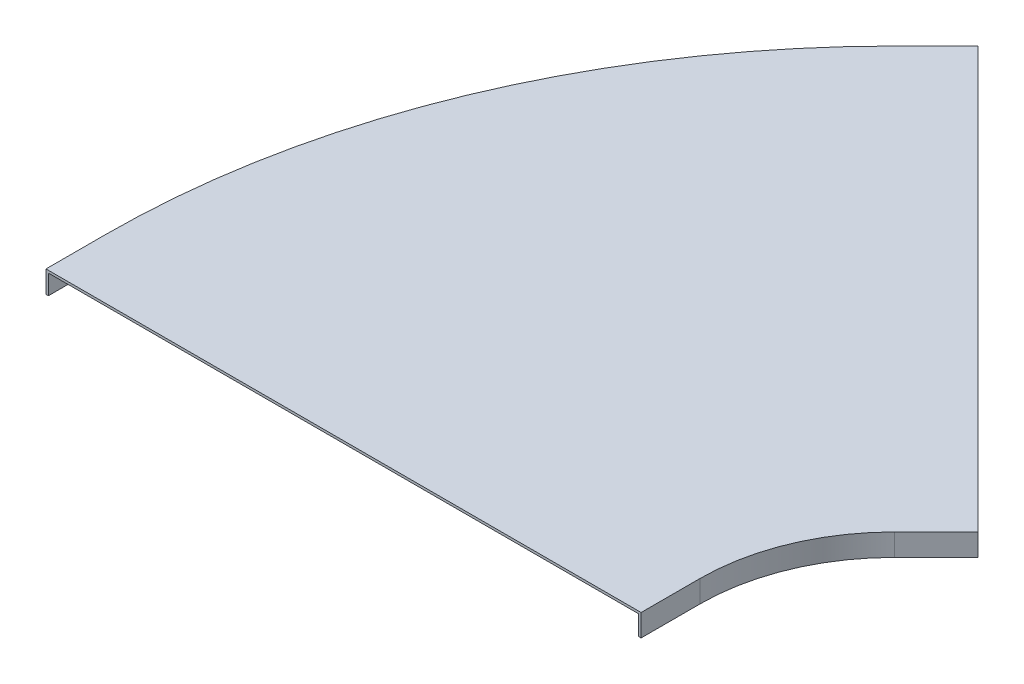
ISO-10303-21;
HEADER;
FILE_DESCRIPTION(('STEP AP214'),'2;1');
FILE_NAME('part.step','',(''),(''),'','','');
FILE_SCHEMA(('AUTOMOTIVE_DESIGN { 1 0 10303 214 1 1 1 1 }'));
ENDSEC;
DATA;
#1=APPLICATION_CONTEXT('core data for automotive mechanical design processes');
#2=APPLICATION_PROTOCOL_DEFINITION('international standard','automotive_design',2000,#1);
#3=PRODUCT_CONTEXT('',#1,'mechanical');
#4=PRODUCT('Part','Part','',(#3));
#5=PRODUCT_RELATED_PRODUCT_CATEGORY('part','',(#4));
#6=PRODUCT_DEFINITION_FORMATION('','',#4);
#7=PRODUCT_DEFINITION_CONTEXT('part definition',#1,'design');
#8=PRODUCT_DEFINITION('design','',#6,#7);
#9=PRODUCT_DEFINITION_SHAPE('','',#8);
#10=(LENGTH_UNIT() NAMED_UNIT(*) SI_UNIT(.MILLI.,.METRE.));
#11=(NAMED_UNIT(*) PLANE_ANGLE_UNIT() SI_UNIT($,.RADIAN.));
#12=(NAMED_UNIT(*) SI_UNIT($,.STERADIAN.) SOLID_ANGLE_UNIT());
#13=UNCERTAINTY_MEASURE_WITH_UNIT(LENGTH_MEASURE(1.E-05),#10,'distance_accuracy_value','');
#14=(GEOMETRIC_REPRESENTATION_CONTEXT(3) GLOBAL_UNCERTAINTY_ASSIGNED_CONTEXT((#13)) GLOBAL_UNIT_ASSIGNED_CONTEXT((#10,
#11,#12)) REPRESENTATION_CONTEXT('',''));
#15=CARTESIAN_POINT('',(0.,0.,0.));
#16=DIRECTION('',(0.,0.,1.));
#17=DIRECTION('',(1.,0.,0.));
#18=AXIS2_PLACEMENT_3D('',#15,#16,#17);
#19=CARTESIAN_POINT('',(29.2893218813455,-10.,-100.710678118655));
#20=DIRECTION('',(0.707106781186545,0.,0.70710678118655));
#21=DIRECTION('',(0.70710678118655,0.,-0.707106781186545));
#22=AXIS2_PLACEMENT_3D('',#19,#20,#21);
#23=PLANE('',#22);
#24=DIRECTION('',(0.,-1.,0.));
#25=VECTOR('',#24,1.);
#26=CARTESIAN_POINT('',(29.2893218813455,-10.,-100.710678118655));
#27=LINE('',#26,#25);
#28=CARTESIAN_POINT('',(29.2893218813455,0.,-100.710678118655));
#29=VERTEX_POINT('',#28);
#30=CARTESIAN_POINT('',(29.2893218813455,-10.,-100.710678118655));
#31=VERTEX_POINT('',#30);
#32=EDGE_CURVE('E156',#29,#31,#27,.T.);
#33=ORIENTED_EDGE('',*,*,#32,.F.);
#34=DIRECTION('',(0.70710678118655,0.,-0.707106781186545));
#35=VECTOR('',#34,1.);
#36=CARTESIAN_POINT('',(29.2893218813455,0.,-100.710678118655));
#37=LINE('',#36,#35);
#38=CARTESIAN_POINT('',(50.5025253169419,0.,-121.923881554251));
#39=VERTEX_POINT('',#38);
#40=EDGE_CURVE('E38',#29,#39,#37,.T.);
#41=ORIENTED_EDGE('',*,*,#40,.T.);
#42=DIRECTION('',(0.,-1.,0.));
#43=VECTOR('',#42,1.);
#44=CARTESIAN_POINT('',(50.5025253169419,-10.,-121.923881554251));
#45=LINE('',#44,#43);
#46=CARTESIAN_POINT('',(50.5025253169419,-10.,-121.923881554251));
#47=VERTEX_POINT('',#46);
#48=EDGE_CURVE('E45',#39,#47,#45,.T.);
#49=ORIENTED_EDGE('',*,*,#48,.T.);
#50=DIRECTION('',(0.70710678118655,0.,-0.707106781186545));
#51=VECTOR('',#50,1.);
#52=CARTESIAN_POINT('',(29.2893218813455,-10.,-100.710678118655));
#53=LINE('',#52,#51);
#54=EDGE_CURVE('E11',#31,#47,#53,.T.);
#55=ORIENTED_EDGE('',*,*,#54,.F.);
#56=EDGE_LOOP('',(#33,#41,#49,#55));
#57=FACE_BOUND('',#56,.T.);
#58=ADVANCED_FACE('F31',(#57),#23,.F.);
#59=CARTESIAN_POINT('',(-182.842712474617,0.,-312.842712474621));
#60=DIRECTION('',(-0.707106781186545,0.,-0.70710678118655));
#61=DIRECTION('',(-0.70710678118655,0.,0.707106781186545));
#62=AXIS2_PLACEMENT_3D('',#59,#60,#61);
#63=PLANE('',#62);
#64=DIRECTION('',(0.,1.,0.));
#65=VECTOR('',#64,1.);
#66=CARTESIAN_POINT('',(-182.842712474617,0.,-312.842712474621));
#67=LINE('',#66,#65);
#68=CARTESIAN_POINT('',(-182.842712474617,-10.,-312.842712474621));
#69=VERTEX_POINT('',#68);
#70=CARTESIAN_POINT('',(-182.842712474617,0.,-312.842712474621));
#71=VERTEX_POINT('',#70);
#72=EDGE_CURVE('E187',#69,#71,#67,.T.);
#73=ORIENTED_EDGE('',*,*,#72,.F.);
#74=DIRECTION('',(0.70710678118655,0.,-0.707106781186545));
#75=VECTOR('',#74,1.);
#76=CARTESIAN_POINT('',(-182.842712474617,-10.,-312.842712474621));
#77=LINE('',#76,#75);
#78=CARTESIAN_POINT('',(-161.629509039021,-10.,-334.055915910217));
#79=VERTEX_POINT('',#78);
#80=EDGE_CURVE('E235',#69,#79,#77,.T.);
#81=ORIENTED_EDGE('',*,*,#80,.T.);
#82=DIRECTION('',(0.,1.,0.));
#83=VECTOR('',#82,1.);
#84=CARTESIAN_POINT('',(-161.629509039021,0.,-334.055915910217));
#85=LINE('',#84,#83);
#86=CARTESIAN_POINT('',(-161.629509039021,0.,-334.055915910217));
#87=VERTEX_POINT('',#86);
#88=EDGE_CURVE('E221',#79,#87,#85,.T.);
#89=ORIENTED_EDGE('',*,*,#88,.T.);
#90=DIRECTION('',(0.70710678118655,0.,-0.707106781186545));
#91=VECTOR('',#90,1.);
#92=CARTESIAN_POINT('',(-182.842712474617,0.,-312.842712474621));
#93=LINE('',#92,#91);
#94=EDGE_CURVE('E238',#71,#87,#93,.T.);
#95=ORIENTED_EDGE('',*,*,#94,.F.);
#96=EDGE_LOOP('',(#73,#81,#89,#95));
#97=FACE_BOUND('',#96,.T.);
#98=ADVANCED_FACE('F310',(#97),#63,.F.);
#99=CARTESIAN_POINT('',(-183.701140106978,1.21399999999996,-313.701140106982));
#100=DIRECTION('',(0.707106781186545,0.,0.70710678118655));
#101=DIRECTION('',(0.70710678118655,0.,-0.707106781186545));
#102=AXIS2_PLACEMENT_3D('',#99,#100,#101);
#103=PLANE('',#102);
#104=DIRECTION('',(0.,-1.,0.));
#105=VECTOR('',#104,1.);
#106=CARTESIAN_POINT('',(-183.701140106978,1.21399999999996,-313.701140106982));
#107=LINE('',#106,#105);
#108=CARTESIAN_POINT('',(-183.701140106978,1.21399999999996,-313.701140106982));
#109=VERTEX_POINT('',#108);
#110=CARTESIAN_POINT('',(-183.701140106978,-10.,-313.701140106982));
#111=VERTEX_POINT('',#110);
#112=EDGE_CURVE('E183',#109,#111,#107,.T.);
#113=ORIENTED_EDGE('',*,*,#112,.F.);
#114=DIRECTION('',(0.70710678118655,0.,-0.707106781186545));
#115=VECTOR('',#114,1.);
#116=CARTESIAN_POINT('',(-183.701140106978,1.21399999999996,-313.701140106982));
#117=LINE('',#116,#115);
#118=CARTESIAN_POINT('',(-162.487936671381,1.21399999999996,-334.914343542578));
#119=VERTEX_POINT('',#118);
#120=EDGE_CURVE('E229',#109,#119,#117,.T.);
#121=ORIENTED_EDGE('',*,*,#120,.T.);
#122=DIRECTION('',(0.,-1.,0.));
#123=VECTOR('',#122,1.);
#124=CARTESIAN_POINT('',(-162.487936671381,1.21399999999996,-334.914343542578));
#125=LINE('',#124,#123);
#126=CARTESIAN_POINT('',(-162.487936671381,-10.,-334.914343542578));
#127=VERTEX_POINT('',#126);
#128=EDGE_CURVE('E217',#119,#127,#125,.T.);
#129=ORIENTED_EDGE('',*,*,#128,.T.);
#130=DIRECTION('',(0.70710678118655,0.,-0.707106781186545));
#131=VECTOR('',#130,1.);
#132=CARTESIAN_POINT('',(-183.701140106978,-10.,-313.701140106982));
#133=LINE('',#132,#131);
#134=EDGE_CURVE('E232',#111,#127,#133,.T.);
#135=ORIENTED_EDGE('',*,*,#134,.F.);
#136=EDGE_LOOP('',(#113,#121,#129,#135));
#137=FACE_BOUND('',#136,.T.);
#138=ADVANCED_FACE('F321',(#137),#103,.F.);
#139=CARTESIAN_POINT('',(30.1477495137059,-10.,-99.8522504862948));
#140=DIRECTION('',(-0.707106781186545,0.,-0.70710678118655));
#141=DIRECTION('',(-0.70710678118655,0.,0.707106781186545));
#142=AXIS2_PLACEMENT_3D('',#139,#140,#141);
#143=PLANE('',#142);
#144=DIRECTION('',(0.,1.,0.));
#145=VECTOR('',#144,1.);
#146=CARTESIAN_POINT('',(30.1477495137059,-10.,-99.8522504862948));
#147=LINE('',#146,#145);
#148=CARTESIAN_POINT('',(30.1477495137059,-10.,-99.8522504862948));
#149=VERTEX_POINT('',#148);
#150=CARTESIAN_POINT('',(30.1477495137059,1.214,-99.8522504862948));
#151=VERTEX_POINT('',#150);
#152=EDGE_CURVE('E181',#149,#151,#147,.T.);
#153=ORIENTED_EDGE('',*,*,#152,.F.);
#154=DIRECTION('',(0.70710678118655,0.,-0.707106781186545));
#155=VECTOR('',#154,1.);
#156=CARTESIAN_POINT('',(30.1477495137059,-10.,-99.8522504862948));
#157=LINE('',#156,#155);
#158=CARTESIAN_POINT('',(51.3609529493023,-10.,-121.065453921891));
#159=VERTEX_POINT('',#158);
#160=EDGE_CURVE('E151',#149,#159,#157,.T.);
#161=ORIENTED_EDGE('',*,*,#160,.T.);
#162=DIRECTION('',(0.,1.,0.));
#163=VECTOR('',#162,1.);
#164=CARTESIAN_POINT('',(51.3609529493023,-10.,-121.065453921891));
#165=LINE('',#164,#163);
#166=CARTESIAN_POINT('',(51.3609529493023,1.214,-121.065453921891));
#167=VERTEX_POINT('',#166);
#168=EDGE_CURVE('E213',#159,#167,#165,.T.);
#169=ORIENTED_EDGE('',*,*,#168,.T.);
#170=DIRECTION('',(0.70710678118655,0.,-0.707106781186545));
#171=VECTOR('',#170,1.);
#172=CARTESIAN_POINT('',(30.1477495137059,1.214,-99.8522504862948));
#173=LINE('',#172,#171);
#174=EDGE_CURVE('E226',#151,#167,#173,.T.);
#175=ORIENTED_EDGE('',*,*,#174,.F.);
#176=EDGE_LOOP('',(#153,#161,#169,#175));
#177=FACE_BOUND('',#176,.T.);
#178=ADVANCED_FACE('F319',(#177),#143,.F.);
#179=CARTESIAN_POINT('',(100.,0.,-30.0000000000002));
#180=DIRECTION('',(0.,-1.,0.));
#181=DIRECTION('',(0.,0.,-1.));
#182=AXIS2_PLACEMENT_3D('',#179,#180,#181);
#183=CYLINDRICAL_SURFACE('',#182,100.);
#184=DIRECTION('',(0.,-1.,0.));
#185=VECTOR('',#184,1.);
#186=CARTESIAN_POINT('',(0.,-10.,-29.9999999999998));
#187=LINE('',#186,#185);
#188=CARTESIAN_POINT('',(0.,0.,-29.9999999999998));
#189=VERTEX_POINT('',#188);
#190=CARTESIAN_POINT('',(0.,-10.,-29.9999999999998));
#191=VERTEX_POINT('',#190);
#192=EDGE_CURVE('E172',#189,#191,#187,.T.);
#193=ORIENTED_EDGE('',*,*,#192,.F.);
#194=CARTESIAN_POINT('',(100.,0.,-30.0000000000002));
#195=DIRECTION('',(0.,-1.,0.));
#196=DIRECTION('',(0.,0.,-1.));
#197=AXIS2_PLACEMENT_3D('',#194,#195,#196);
#198=CIRCLE('',#197,100.);
#199=EDGE_CURVE('E205',#189,#29,#198,.T.);
#200=ORIENTED_EDGE('',*,*,#199,.T.);
#201=ORIENTED_EDGE('',*,*,#32,.T.);
#202=CARTESIAN_POINT('',(100.,-10.,-30.0000000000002));
#203=DIRECTION('',(0.,-1.,0.));
#204=DIRECTION('',(0.,0.,-1.));
#205=AXIS2_PLACEMENT_3D('',#202,#203,#204);
#206=CIRCLE('',#205,100.);
#207=EDGE_CURVE('E208',#191,#31,#206,.T.);
#208=ORIENTED_EDGE('',*,*,#207,.F.);
#209=EDGE_LOOP('',(#193,#200,#201,#208));
#210=FACE_BOUND('',#209,.T.);
#211=ADVANCED_FACE('F247',(#210),#183,.T.);
#212=CARTESIAN_POINT('',(100.,0.,-30.0000000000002));
#213=DIRECTION('',(0.,-1.,0.));
#214=DIRECTION('',(0.,0.,-1.));
#215=AXIS2_PLACEMENT_3D('',#212,#213,#214);
#216=CYLINDRICAL_SURFACE('',#215,400.);
#217=DIRECTION('',(0.,1.,0.));
#218=VECTOR('',#217,1.);
#219=CARTESIAN_POINT('',(-300.,0.,-29.9999999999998));
#220=LINE('',#219,#218);
#221=CARTESIAN_POINT('',(-300.,-10.,-29.9999999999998));
#222=VERTEX_POINT('',#221);
#223=CARTESIAN_POINT('',(-300.,0.,-29.9999999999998));
#224=VERTEX_POINT('',#223);
#225=EDGE_CURVE('E177',#222,#224,#220,.T.);
#226=ORIENTED_EDGE('',*,*,#225,.F.);
#227=CARTESIAN_POINT('',(100.,-10.,-30.0000000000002));
#228=DIRECTION('',(0.,-1.,0.));
#229=DIRECTION('',(0.,0.,-1.));
#230=AXIS2_PLACEMENT_3D('',#227,#228,#229);
#231=CIRCLE('',#230,400.);
#232=EDGE_CURVE('E199',#222,#69,#231,.T.);
#233=ORIENTED_EDGE('',*,*,#232,.T.);
#234=ORIENTED_EDGE('',*,*,#72,.T.);
#235=CARTESIAN_POINT('',(100.,0.,-30.0000000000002));
#236=DIRECTION('',(0.,-1.,0.));
#237=DIRECTION('',(0.,0.,-1.));
#238=AXIS2_PLACEMENT_3D('',#235,#236,#237);
#239=CIRCLE('',#238,400.);
#240=EDGE_CURVE('E202',#224,#71,#239,.T.);
#241=ORIENTED_EDGE('',*,*,#240,.F.);
#242=EDGE_LOOP('',(#226,#233,#234,#241));
#243=FACE_BOUND('',#242,.T.);
#244=ADVANCED_FACE('F308',(#243),#216,.F.);
#245=CARTESIAN_POINT('',(100.,0.,-30.0000000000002));
#246=DIRECTION('',(0.,-1.,0.));
#247=DIRECTION('',(0.,0.,-1.));
#248=AXIS2_PLACEMENT_3D('',#245,#246,#247);
#249=CYLINDRICAL_SURFACE('',#248,401.214);
#250=DIRECTION('',(0.,-1.,0.));
#251=VECTOR('',#250,1.);
#252=CARTESIAN_POINT('',(-301.214,1.21399999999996,-29.9999999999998));
#253=LINE('',#252,#251);
#254=CARTESIAN_POINT('',(-301.214,1.21399999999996,-29.9999999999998));
#255=VERTEX_POINT('',#254);
#256=CARTESIAN_POINT('',(-301.214,-10.,-29.9999999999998));
#257=VERTEX_POINT('',#256);
#258=EDGE_CURVE('E164',#255,#257,#253,.T.);
#259=ORIENTED_EDGE('',*,*,#258,.F.);
#260=CARTESIAN_POINT('',(100.,1.21399999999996,-30.0000000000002));
#261=DIRECTION('',(0.,-1.,0.));
#262=DIRECTION('',(0.,0.,-1.));
#263=AXIS2_PLACEMENT_3D('',#260,#261,#262);
#264=CIRCLE('',#263,401.214);
#265=EDGE_CURVE('E193',#255,#109,#264,.T.);
#266=ORIENTED_EDGE('',*,*,#265,.T.);
#267=ORIENTED_EDGE('',*,*,#112,.T.);
#268=CARTESIAN_POINT('',(100.,-10.,-30.0000000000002));
#269=DIRECTION('',(0.,-1.,0.));
#270=DIRECTION('',(0.,0.,-1.));
#271=AXIS2_PLACEMENT_3D('',#268,#269,#270);
#272=CIRCLE('',#271,401.214);
#273=EDGE_CURVE('E196',#257,#111,#272,.T.);
#274=ORIENTED_EDGE('',*,*,#273,.F.);
#275=EDGE_LOOP('',(#259,#266,#267,#274));
#276=FACE_BOUND('',#275,.T.);
#277=ADVANCED_FACE('F303',(#276),#249,.T.);
#278=CARTESIAN_POINT('',(100.,0.,-30.0000000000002));
#279=DIRECTION('',(0.,-1.,0.));
#280=DIRECTION('',(0.,0.,-1.));
#281=AXIS2_PLACEMENT_3D('',#278,#279,#280);
#282=CYLINDRICAL_SURFACE('',#281,98.786);
#283=DIRECTION('',(0.,1.,0.));
#284=VECTOR('',#283,1.);
#285=CARTESIAN_POINT('',(1.214,-10.,-29.9999999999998));
#286=LINE('',#285,#284);
#287=CARTESIAN_POINT('',(1.214,-10.,-29.9999999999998));
#288=VERTEX_POINT('',#287);
#289=CARTESIAN_POINT('',(1.214,1.214,-29.9999999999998));
#290=VERTEX_POINT('',#289);
#291=EDGE_CURVE('E159',#288,#290,#286,.T.);
#292=ORIENTED_EDGE('',*,*,#291,.F.);
#293=CARTESIAN_POINT('',(100.,-10.,-30.0000000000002));
#294=DIRECTION('',(0.,-1.,0.));
#295=DIRECTION('',(0.,0.,-1.));
#296=AXIS2_PLACEMENT_3D('',#293,#294,#295);
#297=CIRCLE('',#296,98.786);
#298=EDGE_CURVE('E143',#288,#149,#297,.T.);
#299=ORIENTED_EDGE('',*,*,#298,.T.);
#300=ORIENTED_EDGE('',*,*,#152,.T.);
#301=CARTESIAN_POINT('',(100.,1.214,-30.0000000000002));
#302=DIRECTION('',(0.,-1.,0.));
#303=DIRECTION('',(0.,0.,-1.));
#304=AXIS2_PLACEMENT_3D('',#301,#302,#303);
#305=CIRCLE('',#304,98.786);
#306=EDGE_CURVE('E155',#290,#151,#305,.T.);
#307=ORIENTED_EDGE('',*,*,#306,.F.);
#308=EDGE_LOOP('',(#292,#299,#300,#307));
#309=FACE_BOUND('',#308,.T.);
#310=ADVANCED_FACE('F160',(#309),#282,.F.);
#311=CARTESIAN_POINT('',(0.,-10.,-29.9999999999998));
#312=DIRECTION('',(0.,-1.,0.));
#313=DIRECTION('',(0.,0.,-1.));
#314=AXIS2_PLACEMENT_3D('',#311,#312,#313);
#315=PLANE('',#314);
#316=DIRECTION('',(1.,0.,0.));
#317=VECTOR('',#316,1.);
#318=CARTESIAN_POINT('',(0.,-10.,0.));
#319=LINE('',#318,#317);
#320=CARTESIAN_POINT('',(0.,-10.,0.));
#321=VERTEX_POINT('',#320);
#322=CARTESIAN_POINT('',(1.214,-10.,0.));
#323=VERTEX_POINT('',#322);
#324=EDGE_CURVE('E283',#321,#323,#319,.T.);
#325=ORIENTED_EDGE('',*,*,#324,.F.);
#326=DIRECTION('',(0.,0.,1.));
#327=VECTOR('',#326,1.);
#328=CARTESIAN_POINT('',(0.,-10.,-29.9999999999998));
#329=LINE('',#328,#327);
#330=EDGE_CURVE('E184',#191,#321,#329,.T.);
#331=ORIENTED_EDGE('',*,*,#330,.F.);
#332=ORIENTED_EDGE('',*,*,#207,.T.);
#333=ORIENTED_EDGE('',*,*,#54,.T.);
#334=DIRECTION('',(0.707106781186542,0.,0.707106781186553));
#335=VECTOR('',#334,1.);
#336=CARTESIAN_POINT('',(50.5025253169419,-10.,-121.923881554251));
#337=LINE('',#336,#335);
#338=EDGE_CURVE('E211',#47,#159,#337,.T.);
#339=ORIENTED_EDGE('',*,*,#338,.T.);
#340=ORIENTED_EDGE('',*,*,#160,.F.);
#341=ORIENTED_EDGE('',*,*,#298,.F.);
#342=DIRECTION('',(0.,0.,1.));
#343=VECTOR('',#342,1.);
#344=CARTESIAN_POINT('',(1.214,-10.,-29.9999999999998));
#345=LINE('',#344,#343);
#346=EDGE_CURVE('E148',#288,#323,#345,.T.);
#347=ORIENTED_EDGE('',*,*,#346,.T.);
#348=EDGE_LOOP('',(#325,#331,#332,#333,#339,#340,#341,#347));
#349=FACE_BOUND('',#348,.T.);
#350=ADVANCED_FACE('F146',(#349),#315,.T.);
#351=CARTESIAN_POINT('',(0.,-10.,-29.9999999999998));
#352=DIRECTION('',(-1.,0.,0.));
#353=DIRECTION('',(0.,-1.,0.));
#354=AXIS2_PLACEMENT_3D('',#351,#352,#353);
#355=PLANE('',#354);
#356=DIRECTION('',(0.,-1.,0.));
#357=VECTOR('',#356,1.);
#358=CARTESIAN_POINT('',(0.,-10.,0.));
#359=LINE('',#358,#357);
#360=CARTESIAN_POINT('',(0.,0.,0.));
#361=VERTEX_POINT('',#360);
#362=EDGE_CURVE('E165',#361,#321,#359,.T.);
#363=ORIENTED_EDGE('',*,*,#362,.F.);
#364=DIRECTION('',(0.,0.,1.));
#365=VECTOR('',#364,1.);
#366=CARTESIAN_POINT('',(0.,0.,-29.9999999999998));
#367=LINE('',#366,#365);
#368=EDGE_CURVE('E244',#189,#361,#367,.T.);
#369=ORIENTED_EDGE('',*,*,#368,.F.);
#370=ORIENTED_EDGE('',*,*,#192,.T.);
#371=ORIENTED_EDGE('',*,*,#330,.T.);
#372=EDGE_LOOP('',(#363,#369,#370,#371));
#373=FACE_BOUND('',#372,.T.);
#374=ADVANCED_FACE('F251',(#373),#355,.T.);
#375=CARTESIAN_POINT('',(0.,0.,-29.9999999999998));
#376=DIRECTION('',(0.,-1.,0.));
#377=DIRECTION('',(1.,0.,0.));
#378=AXIS2_PLACEMENT_3D('',#375,#376,#377);
#379=PLANE('',#378);
#380=DIRECTION('',(1.,0.,0.));
#381=VECTOR('',#380,1.);
#382=CARTESIAN_POINT('',(0.,0.,0.));
#383=LINE('',#382,#381);
#384=CARTESIAN_POINT('',(-300.,0.,0.));
#385=VERTEX_POINT('',#384);
#386=EDGE_CURVE('E291',#385,#361,#383,.T.);
#387=ORIENTED_EDGE('',*,*,#386,.F.);
#388=DIRECTION('',(0.,0.,1.));
#389=VECTOR('',#388,1.);
#390=CARTESIAN_POINT('',(-300.,0.,-29.9999999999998));
#391=LINE('',#390,#389);
#392=EDGE_CURVE('E253',#224,#385,#391,.T.);
#393=ORIENTED_EDGE('',*,*,#392,.F.);
#394=ORIENTED_EDGE('',*,*,#240,.T.);
#395=ORIENTED_EDGE('',*,*,#94,.T.);
#396=DIRECTION('',(0.707106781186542,0.,0.707106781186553));
#397=VECTOR('',#396,1.);
#398=CARTESIAN_POINT('',(50.5025253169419,0.,-121.923881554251));
#399=LINE('',#398,#397);
#400=EDGE_CURVE('E53',#87,#39,#399,.T.);
#401=ORIENTED_EDGE('',*,*,#400,.T.);
#402=ORIENTED_EDGE('',*,*,#40,.F.);
#403=ORIENTED_EDGE('',*,*,#199,.F.);
#404=ORIENTED_EDGE('',*,*,#368,.T.);
#405=EDGE_LOOP('',(#387,#393,#394,#395,#401,#402,#403,#404));
#406=FACE_BOUND('',#405,.T.);
#407=ADVANCED_FACE('F241',(#406),#379,.T.);
#408=CARTESIAN_POINT('',(-300.,0.,-29.9999999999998));
#409=DIRECTION('',(1.,0.,0.));
#410=DIRECTION('',(0.,0.,-1.));
#411=AXIS2_PLACEMENT_3D('',#408,#409,#410);
#412=PLANE('',#411);
#413=DIRECTION('',(0.,1.,0.));
#414=VECTOR('',#413,1.);
#415=CARTESIAN_POINT('',(-300.,0.,0.));
#416=LINE('',#415,#414);
#417=CARTESIAN_POINT('',(-300.,-10.,0.));
#418=VERTEX_POINT('',#417);
#419=EDGE_CURVE('E288',#418,#385,#416,.T.);
#420=ORIENTED_EDGE('',*,*,#419,.F.);
#421=DIRECTION('',(0.,0.,1.));
#422=VECTOR('',#421,1.);
#423=CARTESIAN_POINT('',(-300.,-10.,-29.9999999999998));
#424=LINE('',#423,#422);
#425=EDGE_CURVE('E256',#222,#418,#424,.T.);
#426=ORIENTED_EDGE('',*,*,#425,.F.);
#427=ORIENTED_EDGE('',*,*,#225,.T.);
#428=ORIENTED_EDGE('',*,*,#392,.T.);
#429=EDGE_LOOP('',(#420,#426,#427,#428));
#430=FACE_BOUND('',#429,.T.);
#431=ADVANCED_FACE('F298',(#430),#412,.T.);
#432=CARTESIAN_POINT('',(-300.,-10.,-29.9999999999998));
#433=DIRECTION('',(0.,-1.,0.));
#434=DIRECTION('',(0.,0.,-1.));
#435=AXIS2_PLACEMENT_3D('',#432,#433,#434);
#436=PLANE('',#435);
#437=DIRECTION('',(1.,0.,0.));
#438=VECTOR('',#437,1.);
#439=CARTESIAN_POINT('',(-300.,-10.,0.));
#440=LINE('',#439,#438);
#441=CARTESIAN_POINT('',(-301.214,-10.,0.));
#442=VERTEX_POINT('',#441);
#443=EDGE_CURVE('E279',#442,#418,#440,.T.);
#444=ORIENTED_EDGE('',*,*,#443,.F.);
#445=DIRECTION('',(0.,0.,1.));
#446=VECTOR('',#445,1.);
#447=CARTESIAN_POINT('',(-301.214,-10.,-29.9999999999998));
#448=LINE('',#447,#446);
#449=EDGE_CURVE('E261',#257,#442,#448,.T.);
#450=ORIENTED_EDGE('',*,*,#449,.F.);
#451=ORIENTED_EDGE('',*,*,#273,.T.);
#452=ORIENTED_EDGE('',*,*,#134,.T.);
#453=DIRECTION('',(0.707106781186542,0.,0.707106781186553));
#454=VECTOR('',#453,1.);
#455=CARTESIAN_POINT('',(-161.629509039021,-10.,-334.055915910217));
#456=LINE('',#455,#454);
#457=EDGE_CURVE('E219',#127,#79,#456,.T.);
#458=ORIENTED_EDGE('',*,*,#457,.T.);
#459=ORIENTED_EDGE('',*,*,#80,.F.);
#460=ORIENTED_EDGE('',*,*,#232,.F.);
#461=ORIENTED_EDGE('',*,*,#425,.T.);
#462=EDGE_LOOP('',(#444,#450,#451,#452,#458,#459,#460,#461));
#463=FACE_BOUND('',#462,.T.);
#464=ADVANCED_FACE('F306',(#463),#436,.T.);
#465=CARTESIAN_POINT('',(-301.214,1.21399999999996,-29.9999999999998));
#466=DIRECTION('',(-1.,0.,0.));
#467=DIRECTION('',(0.,0.,1.));
#468=AXIS2_PLACEMENT_3D('',#465,#466,#467);
#469=PLANE('',#468);
#470=DIRECTION('',(0.,-1.,0.));
#471=VECTOR('',#470,1.);
#472=CARTESIAN_POINT('',(-301.214,1.21399999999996,0.));
#473=LINE('',#472,#471);
#474=CARTESIAN_POINT('',(-301.214,1.21399999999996,0.));
#475=VERTEX_POINT('',#474);
#476=EDGE_CURVE('E273',#475,#442,#473,.T.);
#477=ORIENTED_EDGE('',*,*,#476,.F.);
#478=DIRECTION('',(0.,0.,1.));
#479=VECTOR('',#478,1.);
#480=CARTESIAN_POINT('',(-301.214,1.21399999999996,-29.9999999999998));
#481=LINE('',#480,#479);
#482=EDGE_CURVE('E174',#255,#475,#481,.T.);
#483=ORIENTED_EDGE('',*,*,#482,.F.);
#484=ORIENTED_EDGE('',*,*,#258,.T.);
#485=ORIENTED_EDGE('',*,*,#449,.T.);
#486=EDGE_LOOP('',(#477,#483,#484,#485));
#487=FACE_BOUND('',#486,.T.);
#488=ADVANCED_FACE('F274',(#487),#469,.T.);
#489=CARTESIAN_POINT('',(1.214,1.214,-29.9999999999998));
#490=DIRECTION('',(0.,1.,0.));
#491=DIRECTION('',(-1.,0.,0.));
#492=AXIS2_PLACEMENT_3D('',#489,#490,#491);
#493=PLANE('',#492);
#494=DIRECTION('',(-1.,0.,0.));
#495=VECTOR('',#494,1.);
#496=CARTESIAN_POINT('',(1.214,1.214,0.));
#497=LINE('',#496,#495);
#498=CARTESIAN_POINT('',(1.214,1.214,0.));
#499=VERTEX_POINT('',#498);
#500=EDGE_CURVE('E268',#499,#475,#497,.T.);
#501=ORIENTED_EDGE('',*,*,#500,.F.);
#502=DIRECTION('',(0.,0.,1.));
#503=VECTOR('',#502,1.);
#504=CARTESIAN_POINT('',(1.214,1.214,-29.9999999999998));
#505=LINE('',#504,#503);
#506=EDGE_CURVE('E171',#290,#499,#505,.T.);
#507=ORIENTED_EDGE('',*,*,#506,.F.);
#508=ORIENTED_EDGE('',*,*,#306,.T.);
#509=ORIENTED_EDGE('',*,*,#174,.T.);
#510=DIRECTION('',(-0.707106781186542,0.,-0.707106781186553));
#511=VECTOR('',#510,1.);
#512=CARTESIAN_POINT('',(51.3609529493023,1.214,-121.065453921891));
#513=LINE('',#512,#511);
#514=EDGE_CURVE('E215',#167,#119,#513,.T.);
#515=ORIENTED_EDGE('',*,*,#514,.T.);
#516=ORIENTED_EDGE('',*,*,#120,.F.);
#517=ORIENTED_EDGE('',*,*,#265,.F.);
#518=ORIENTED_EDGE('',*,*,#482,.T.);
#519=EDGE_LOOP('',(#501,#507,#508,#509,#515,#516,#517,#518));
#520=FACE_BOUND('',#519,.T.);
#521=ADVANCED_FACE('F266',(#520),#493,.T.);
#522=CARTESIAN_POINT('',(1.214,-10.,-29.9999999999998));
#523=DIRECTION('',(1.,0.,0.));
#524=DIRECTION('',(0.,0.,-1.));
#525=AXIS2_PLACEMENT_3D('',#522,#523,#524);
#526=PLANE('',#525);
#527=DIRECTION('',(0.,1.,0.));
#528=VECTOR('',#527,1.);
#529=CARTESIAN_POINT('',(1.214,-10.,0.));
#530=LINE('',#529,#528);
#531=EDGE_CURVE('E169',#323,#499,#530,.T.);
#532=ORIENTED_EDGE('',*,*,#531,.F.);
#533=ORIENTED_EDGE('',*,*,#346,.F.);
#534=ORIENTED_EDGE('',*,*,#291,.T.);
#535=ORIENTED_EDGE('',*,*,#506,.T.);
#536=EDGE_LOOP('',(#532,#533,#534,#535));
#537=FACE_BOUND('',#536,.T.);
#538=ADVANCED_FACE('F167',(#537),#526,.T.);
#539=CARTESIAN_POINT('',(51.3609529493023,-10.,-121.065453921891));
#540=DIRECTION('',(-0.707106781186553,0.,0.707106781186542));
#541=DIRECTION('',(0.707106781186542,0.,0.707106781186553));
#542=AXIS2_PLACEMENT_3D('',#539,#540,#541);
#543=PLANE('',#542);
#544=ORIENTED_EDGE('',*,*,#338,.F.);
#545=ORIENTED_EDGE('',*,*,#48,.F.);
#546=ORIENTED_EDGE('',*,*,#400,.F.);
#547=ORIENTED_EDGE('',*,*,#88,.F.);
#548=ORIENTED_EDGE('',*,*,#457,.F.);
#549=ORIENTED_EDGE('',*,*,#128,.F.);
#550=ORIENTED_EDGE('',*,*,#514,.F.);
#551=ORIENTED_EDGE('',*,*,#168,.F.);
#552=EDGE_LOOP('',(#544,#545,#546,#547,#548,#549,#550,#551));
#553=FACE_BOUND('',#552,.T.);
#554=ADVANCED_FACE('F314',(#553),#543,.F.);
#555=CARTESIAN_POINT('',(1.214,-10.,0.));
#556=DIRECTION('',(0.,0.,1.));
#557=DIRECTION('',(1.,0.,0.));
#558=AXIS2_PLACEMENT_3D('',#555,#556,#557);
#559=PLANE('',#558);
#560=ORIENTED_EDGE('',*,*,#324,.T.);
#561=ORIENTED_EDGE('',*,*,#531,.T.);
#562=ORIENTED_EDGE('',*,*,#500,.T.);
#563=ORIENTED_EDGE('',*,*,#476,.T.);
#564=ORIENTED_EDGE('',*,*,#443,.T.);
#565=ORIENTED_EDGE('',*,*,#419,.T.);
#566=ORIENTED_EDGE('',*,*,#386,.T.);
#567=ORIENTED_EDGE('',*,*,#362,.T.);
#568=EDGE_LOOP('',(#560,#561,#562,#563,#564,#565,#566,#567));
#569=FACE_BOUND('',#568,.T.);
#570=ADVANCED_FACE('F281',(#569),#559,.T.);
#571=CLOSED_SHELL('',(#58,#98,#138,#178,#211,#244,#277,#310,#350,#374,#407,#431,#464,#488,#521,
#538,#554,#570));
#572=MANIFOLD_SOLID_BREP('B2',#571);
#573=ADVANCED_BREP_SHAPE_REPRESENTATION('',(#18,#572),#14);
#574=SHAPE_DEFINITION_REPRESENTATION(#9,#573);
ENDSEC;
END-ISO-10303-21;
